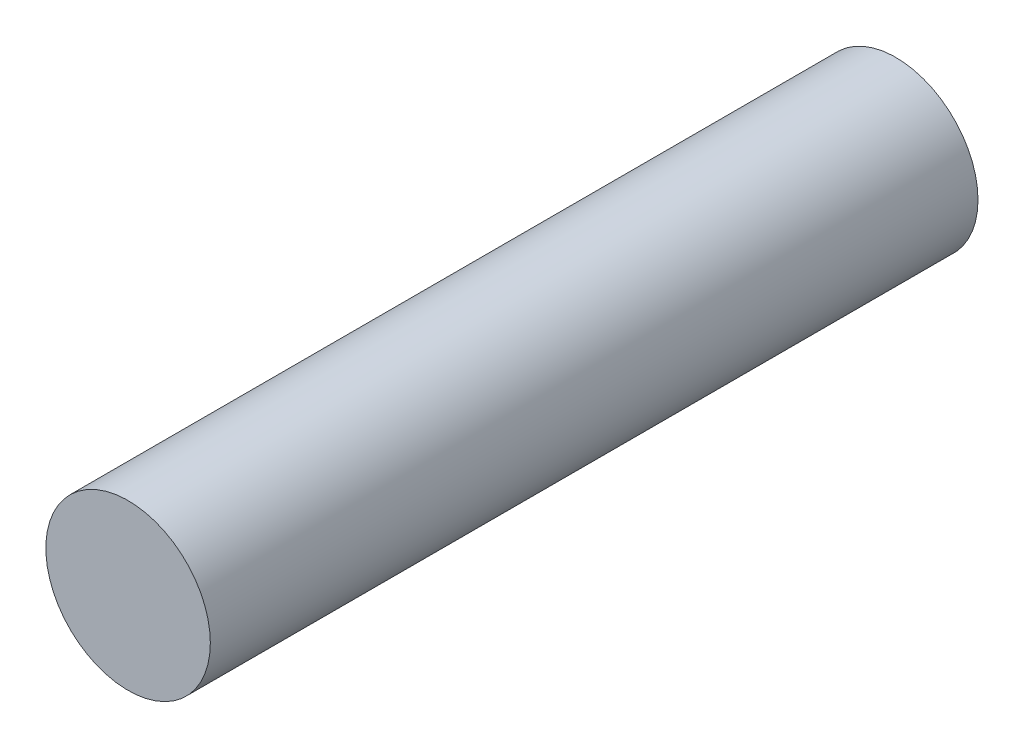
ISO-10303-21;
HEADER;
FILE_DESCRIPTION(('STEP AP214'),'2;1');
FILE_NAME('part.step','',(''),(''),'','','');
FILE_SCHEMA(('AUTOMOTIVE_DESIGN { 1 0 10303 214 1 1 1 1 }'));
ENDSEC;
DATA;
#1=APPLICATION_CONTEXT('core data for automotive mechanical design processes');
#2=APPLICATION_PROTOCOL_DEFINITION('international standard','automotive_design',2000,#1);
#3=PRODUCT_CONTEXT('',#1,'mechanical');
#4=PRODUCT('Part','Part','',(#3));
#5=PRODUCT_RELATED_PRODUCT_CATEGORY('part','',(#4));
#6=PRODUCT_DEFINITION_FORMATION('','',#4);
#7=PRODUCT_DEFINITION_CONTEXT('part definition',#1,'design');
#8=PRODUCT_DEFINITION('design','',#6,#7);
#9=PRODUCT_DEFINITION_SHAPE('','',#8);
#10=(LENGTH_UNIT() NAMED_UNIT(*) SI_UNIT(.MILLI.,.METRE.));
#11=(NAMED_UNIT(*) PLANE_ANGLE_UNIT() SI_UNIT($,.RADIAN.));
#12=(NAMED_UNIT(*) SI_UNIT($,.STERADIAN.) SOLID_ANGLE_UNIT());
#13=UNCERTAINTY_MEASURE_WITH_UNIT(LENGTH_MEASURE(1.E-05),#10,'distance_accuracy_value','');
#14=(GEOMETRIC_REPRESENTATION_CONTEXT(3) GLOBAL_UNCERTAINTY_ASSIGNED_CONTEXT((#13)) GLOBAL_UNIT_ASSIGNED_CONTEXT((#10,
#11,#12)) REPRESENTATION_CONTEXT('',''));
#15=CARTESIAN_POINT('',(0.,0.,0.));
#16=DIRECTION('',(0.,0.,1.));
#17=DIRECTION('',(1.,0.,0.));
#18=AXIS2_PLACEMENT_3D('',#15,#16,#17);
#19=CARTESIAN_POINT('',(0.,0.,14.));
#20=DIRECTION('',(0.,0.,-1.));
#21=DIRECTION('',(-1.,0.,0.));
#22=AXIS2_PLACEMENT_3D('',#19,#20,#21);
#23=CYLINDRICAL_SURFACE('',#22,1.5);
#24=CARTESIAN_POINT('',(0.,0.,14.));
#25=DIRECTION('',(0.,0.,1.));
#26=DIRECTION('',(1.,0.,0.));
#27=AXIS2_PLACEMENT_3D('',#24,#25,#26);
#28=CIRCLE('',#27,1.5);
#29=CARTESIAN_POINT('',(1.5,0.,14.));
#30=VERTEX_POINT('',#29);
#31=EDGE_CURVE('E10',#30,#30,#28,.T.);
#32=ORIENTED_EDGE('',*,*,#31,.F.);
#33=EDGE_LOOP('',(#32));
#34=FACE_BOUND('',#33,.T.);
#35=CARTESIAN_POINT('',(0.,0.,0.));
#36=DIRECTION('',(0.,0.,1.));
#37=DIRECTION('',(1.,0.,0.));
#38=AXIS2_PLACEMENT_3D('',#35,#36,#37);
#39=CIRCLE('',#38,1.5);
#40=CARTESIAN_POINT('',(1.5,0.,0.));
#41=VERTEX_POINT('',#40);
#42=EDGE_CURVE('E35',#41,#41,#39,.T.);
#43=ORIENTED_EDGE('',*,*,#42,.T.);
#44=EDGE_LOOP('',(#43));
#45=FACE_BOUND('',#44,.T.);
#46=ADVANCED_FACE('F32',(#34,#45),#23,.T.);
#47=CARTESIAN_POINT('',(0.,0.,14.));
#48=DIRECTION('',(0.,0.,1.));
#49=DIRECTION('',(1.,0.,0.));
#50=AXIS2_PLACEMENT_3D('',#47,#48,#49);
#51=PLANE('',#50);
#52=ORIENTED_EDGE('',*,*,#31,.T.);
#53=EDGE_LOOP('',(#52));
#54=FACE_BOUND('',#53,.T.);
#55=ADVANCED_FACE('F47',(#54),#51,.T.);
#56=CARTESIAN_POINT('',(0.,0.,0.));
#57=DIRECTION('',(0.,0.,1.));
#58=DIRECTION('',(1.,0.,0.));
#59=AXIS2_PLACEMENT_3D('',#56,#57,#58);
#60=PLANE('',#59);
#61=ORIENTED_EDGE('',*,*,#42,.F.);
#62=EDGE_LOOP('',(#61));
#63=FACE_BOUND('',#62,.T.);
#64=ADVANCED_FACE('F45',(#63),#60,.F.);
#65=CLOSED_SHELL('',(#46,#55,#64));
#66=MANIFOLD_SOLID_BREP('B2',#65);
#67=ADVANCED_BREP_SHAPE_REPRESENTATION('',(#18,#66),#14);
#68=SHAPE_DEFINITION_REPRESENTATION(#9,#67);
ENDSEC;
END-ISO-10303-21;
